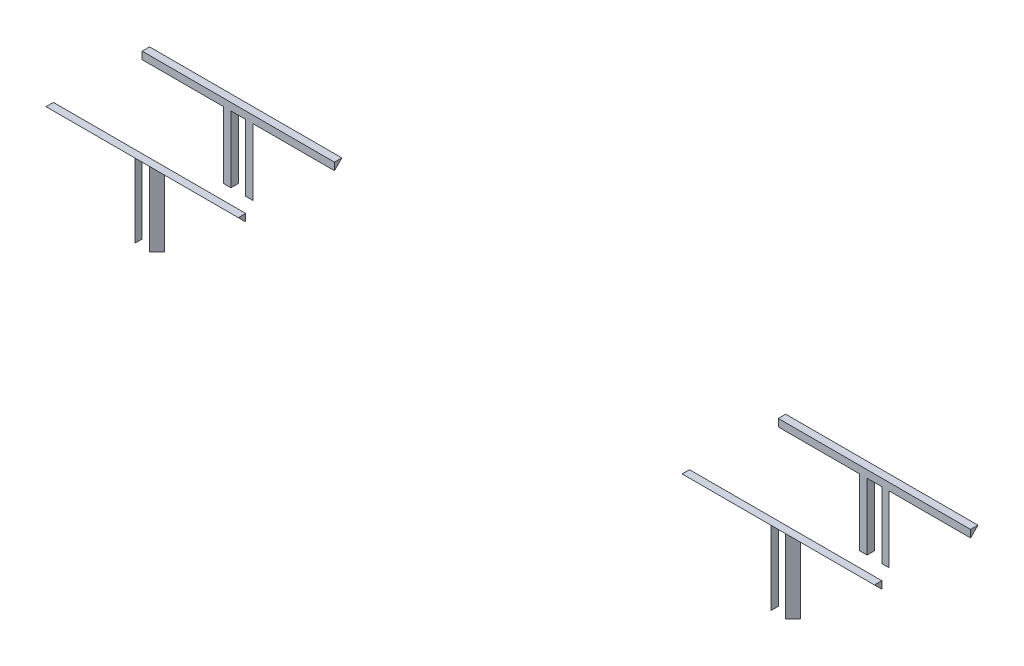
ISO-10303-21;
HEADER;
FILE_DESCRIPTION(('STEP AP214'),'2;1');
FILE_NAME('part.step','',(''),(''),'','','');
FILE_SCHEMA(('AUTOMOTIVE_DESIGN { 1 0 10303 214 1 1 1 1 }'));
ENDSEC;
DATA;
#1=APPLICATION_CONTEXT('core data for automotive mechanical design processes');
#2=APPLICATION_PROTOCOL_DEFINITION('international standard','automotive_design',2000,#1);
#3=PRODUCT_CONTEXT('',#1,'mechanical');
#4=PRODUCT('Part','Part','',(#3));
#5=PRODUCT_RELATED_PRODUCT_CATEGORY('part','',(#4));
#6=PRODUCT_DEFINITION_FORMATION('','',#4);
#7=PRODUCT_DEFINITION_CONTEXT('part definition',#1,'design');
#8=PRODUCT_DEFINITION('design','',#6,#7);
#9=PRODUCT_DEFINITION_SHAPE('','',#8);
#10=(LENGTH_UNIT() NAMED_UNIT(*) SI_UNIT(.MILLI.,.METRE.));
#11=(NAMED_UNIT(*) PLANE_ANGLE_UNIT() SI_UNIT($,.RADIAN.));
#12=(NAMED_UNIT(*) SI_UNIT($,.STERADIAN.) SOLID_ANGLE_UNIT());
#13=UNCERTAINTY_MEASURE_WITH_UNIT(LENGTH_MEASURE(1.E-05),#10,'distance_accuracy_value','');
#14=(GEOMETRIC_REPRESENTATION_CONTEXT(3) GLOBAL_UNCERTAINTY_ASSIGNED_CONTEXT((#13)) GLOBAL_UNIT_ASSIGNED_CONTEXT((#10,
#11,#12)) REPRESENTATION_CONTEXT('',''));
#15=CARTESIAN_POINT('',(0.,0.,0.));
#16=DIRECTION('',(0.,0.,1.));
#17=DIRECTION('',(1.,0.,0.));
#18=AXIS2_PLACEMENT_3D('',#15,#16,#17);
#19=CARTESIAN_POINT('',(238.343633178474,47.9752658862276,60.));
#20=DIRECTION('',(1.,0.,0.));
#21=DIRECTION('',(0.,0.,-1.));
#22=AXIS2_PLACEMENT_3D('',#19,#20,#21);
#23=PLANE('',#22);
#24=DIRECTION('',(0.,1.,0.));
#25=VECTOR('',#24,1.);
#26=CARTESIAN_POINT('',(238.343633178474,8.13078659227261,60.));
#27=LINE('',#26,#25);
#28=CARTESIAN_POINT('',(238.343633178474,47.9752658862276,60.));
#29=VERTEX_POINT('',#28);
#30=CARTESIAN_POINT('',(238.343633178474,42.9752658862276,60.));
#31=VERTEX_POINT('',#30);
#32=EDGE_CURVE('P0_E20',#29,#31,#27,.F.);
#33=ORIENTED_EDGE('',*,*,#32,.T.);
#34=DIRECTION('',(0.,-0.707106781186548,-0.707106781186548));
#35=VECTOR('',#34,1.);
#36=CARTESIAN_POINT('',(238.343633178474,42.9752658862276,60.));
#37=LINE('',#36,#35);
#38=CARTESIAN_POINT('',(238.343633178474,47.9752658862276,65.));
#39=VERTEX_POINT('',#38);
#40=EDGE_CURVE('P0_E171',#39,#31,#37,.T.);
#41=ORIENTED_EDGE('',*,*,#40,.F.);
#42=DIRECTION('',(0.,0.,-1.));
#43=VECTOR('',#42,1.);
#44=CARTESIAN_POINT('',(238.343633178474,47.9752658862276,30.0000000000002));
#45=LINE('',#44,#43);
#46=EDGE_CURVE('P0_E143',#39,#29,#45,.T.);
#47=ORIENTED_EDGE('',*,*,#46,.T.);
#48=EDGE_LOOP('',(#33,#41,#47));
#49=FACE_BOUND('',#48,.T.);
#50=ADVANCED_FACE('P0_F16',(#49),#23,.F.);
#51=CARTESIAN_POINT('',(238.343633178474,42.9752658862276,60.));
#52=DIRECTION('',(0.,-0.707106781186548,0.707106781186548));
#53=DIRECTION('',(0.,-0.707106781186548,-0.707106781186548));
#54=AXIS2_PLACEMENT_3D('',#51,#52,#53);
#55=PLANE('',#54);
#56=ORIENTED_EDGE('',*,*,#40,.T.);
#57=DIRECTION('',(1.,0.,0.));
#58=VECTOR('',#57,1.);
#59=CARTESIAN_POINT('',(88.3436331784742,42.9752658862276,60.));
#60=LINE('',#59,#58);
#61=CARTESIAN_POINT('',(293.343633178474,42.9752658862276,60.));
#62=VERTEX_POINT('',#61);
#63=EDGE_CURVE('P0_E167',#31,#62,#60,.T.);
#64=ORIENTED_EDGE('',*,*,#63,.T.);
#65=DIRECTION('',(-0.577350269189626,-0.577350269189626,-0.577350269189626));
#66=VECTOR('',#65,1.);
#67=CARTESIAN_POINT('',(298.343633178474,47.9752658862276,65.));
#68=LINE('',#67,#66);
#69=CARTESIAN_POINT('',(298.343633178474,47.9752658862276,65.));
#70=VERTEX_POINT('',#69);
#71=EDGE_CURVE('P0_E122',#70,#62,#68,.T.);
#72=ORIENTED_EDGE('',*,*,#71,.F.);
#73=DIRECTION('',(1.,0.,0.));
#74=VECTOR('',#73,1.);
#75=CARTESIAN_POINT('',(303.343633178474,47.9752658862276,65.));
#76=LINE('',#75,#74);
#77=EDGE_CURVE('P0_E145',#70,#39,#76,.F.);
#78=ORIENTED_EDGE('',*,*,#77,.T.);
#79=EDGE_LOOP('',(#56,#64,#72,#78));
#80=FACE_BOUND('',#79,.T.);
#81=ADVANCED_FACE('P0_F218',(#80),#55,.T.);
#82=CARTESIAN_POINT('',(298.343633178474,-2.0247341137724,65.));
#83=DIRECTION('',(-0.707106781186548,0.,0.707106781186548));
#84=DIRECTION('',(0.707106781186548,0.,0.707106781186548));
#85=AXIS2_PLACEMENT_3D('',#82,#83,#84);
#86=PLANE('',#85);
#87=DIRECTION('',(0.707106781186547,0.,0.707106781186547));
#88=VECTOR('',#87,1.);
#89=CARTESIAN_POINT('',(293.343633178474,-2.0247341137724,60.));
#90=LINE('',#89,#88);
#91=CARTESIAN_POINT('',(293.343633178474,-2.0247341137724,60.));
#92=VERTEX_POINT('',#91);
#93=CARTESIAN_POINT('',(298.343633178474,-2.0247341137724,65.));
#94=VERTEX_POINT('',#93);
#95=EDGE_CURVE('P0_E113',#92,#94,#90,.T.);
#96=ORIENTED_EDGE('',*,*,#95,.T.);
#97=DIRECTION('',(0.,1.,0.));
#98=VECTOR('',#97,1.);
#99=CARTESIAN_POINT('',(298.343633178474,22.9752658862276,65.));
#100=LINE('',#99,#98);
#101=EDGE_CURVE('P0_E103',#70,#94,#100,.F.);
#102=ORIENTED_EDGE('',*,*,#101,.F.);
#103=ORIENTED_EDGE('',*,*,#71,.T.);
#104=DIRECTION('',(0.,1.,0.));
#105=VECTOR('',#104,1.);
#106=CARTESIAN_POINT('',(293.343633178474,8.13078659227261,60.));
#107=LINE('',#106,#105);
#108=EDGE_CURVE('P0_E118',#62,#92,#107,.F.);
#109=ORIENTED_EDGE('',*,*,#108,.T.);
#110=EDGE_LOOP('',(#96,#102,#103,#109));
#111=FACE_BOUND('',#110,.T.);
#112=ADVANCED_FACE('P0_F116',(#111),#86,.T.);
#113=CARTESIAN_POINT('',(298.343633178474,-2.0247341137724,60.));
#114=DIRECTION('',(0.,1.,0.));
#115=DIRECTION('',(0.,0.,1.));
#116=AXIS2_PLACEMENT_3D('',#113,#114,#115);
#117=PLANE('',#116);
#118=ORIENTED_EDGE('',*,*,#95,.F.);
#119=DIRECTION('',(1.,0.,0.));
#120=VECTOR('',#119,1.);
#121=CARTESIAN_POINT('',(88.3436331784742,-2.0247341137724,60.));
#122=LINE('',#121,#120);
#123=CARTESIAN_POINT('',(298.343633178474,-2.0247341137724,60.));
#124=VERTEX_POINT('',#123);
#125=EDGE_CURVE('P0_E125',#92,#124,#122,.T.);
#126=ORIENTED_EDGE('',*,*,#125,.T.);
#127=DIRECTION('',(0.,0.,-1.));
#128=VECTOR('',#127,1.);
#129=CARTESIAN_POINT('',(298.343633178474,-2.0247341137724,120.));
#130=LINE('',#129,#128);
#131=EDGE_CURVE('P0_E108',#94,#124,#130,.T.);
#132=ORIENTED_EDGE('',*,*,#131,.F.);
#133=EDGE_LOOP('',(#118,#126,#132));
#134=FACE_BOUND('',#133,.T.);
#135=ADVANCED_FACE('P0_F124',(#134),#117,.F.);
#136=CARTESIAN_POINT('',(298.343633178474,22.9752658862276,120.));
#137=DIRECTION('',(1.,0.,0.));
#138=DIRECTION('',(0.,0.,-1.));
#139=AXIS2_PLACEMENT_3D('',#136,#137,#138);
#140=PLANE('',#139);
#141=ORIENTED_EDGE('',*,*,#131,.T.);
#142=DIRECTION('',(0.,1.,0.));
#143=VECTOR('',#142,1.);
#144=CARTESIAN_POINT('',(298.343633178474,8.13078659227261,60.));
#145=LINE('',#144,#143);
#146=CARTESIAN_POINT('',(298.343633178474,42.9752658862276,60.));
#147=VERTEX_POINT('',#146);
#148=EDGE_CURVE('P0_E164',#124,#147,#145,.T.);
#149=ORIENTED_EDGE('',*,*,#148,.T.);
#150=DIRECTION('',(0.,-0.707106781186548,-0.707106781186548));
#151=VECTOR('',#150,1.);
#152=CARTESIAN_POINT('',(298.343633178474,42.9752658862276,60.));
#153=LINE('',#152,#151);
#154=EDGE_CURVE('P0_E110',#70,#147,#153,.T.);
#155=ORIENTED_EDGE('',*,*,#154,.F.);
#156=ORIENTED_EDGE('',*,*,#101,.T.);
#157=EDGE_LOOP('',(#141,#149,#155,#156));
#158=FACE_BOUND('',#157,.T.);
#159=ADVANCED_FACE('P0_F105',(#158),#140,.T.);
#160=CARTESIAN_POINT('',(238.343633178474,42.9752658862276,60.));
#161=DIRECTION('',(0.,-0.707106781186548,0.707106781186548));
#162=DIRECTION('',(0.,-0.707106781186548,-0.707106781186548));
#163=AXIS2_PLACEMENT_3D('',#160,#161,#162);
#164=PLANE('',#163);
#165=ORIENTED_EDGE('',*,*,#154,.T.);
#166=DIRECTION('',(1.,0.,0.));
#167=VECTOR('',#166,1.);
#168=CARTESIAN_POINT('',(88.3436331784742,42.9752658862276,60.));
#169=LINE('',#168,#167);
#170=CARTESIAN_POINT('',(308.343633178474,42.9752658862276,60.));
#171=VERTEX_POINT('',#170);
#172=EDGE_CURVE('P0_E162',#147,#171,#169,.T.);
#173=ORIENTED_EDGE('',*,*,#172,.T.);
#174=DIRECTION('',(0.,0.707106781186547,0.707106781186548));
#175=VECTOR('',#174,1.);
#176=CARTESIAN_POINT('',(308.343633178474,42.9752658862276,60.));
#177=LINE('',#176,#175);
#178=CARTESIAN_POINT('',(308.343633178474,47.9752658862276,65.));
#179=VERTEX_POINT('',#178);
#180=EDGE_CURVE('P0_E90',#171,#179,#177,.T.);
#181=ORIENTED_EDGE('',*,*,#180,.T.);
#182=DIRECTION('',(1.,0.,0.));
#183=VECTOR('',#182,1.);
#184=CARTESIAN_POINT('',(303.343633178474,47.9752658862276,65.));
#185=LINE('',#184,#183);
#186=EDGE_CURVE('P0_E139',#179,#70,#185,.F.);
#187=ORIENTED_EDGE('',*,*,#186,.T.);
#188=EDGE_LOOP('',(#165,#173,#181,#187));
#189=FACE_BOUND('',#188,.T.);
#190=ADVANCED_FACE('P0_F204',(#189),#164,.T.);
#191=CARTESIAN_POINT('',(308.343633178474,22.9752658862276,120.));
#192=DIRECTION('',(1.,0.,0.));
#193=DIRECTION('',(0.,0.,-1.));
#194=AXIS2_PLACEMENT_3D('',#191,#192,#193);
#195=PLANE('',#194);
#196=DIRECTION('',(0.,1.,0.));
#197=VECTOR('',#196,1.);
#198=CARTESIAN_POINT('',(308.343633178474,8.13078659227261,60.));
#199=LINE('',#198,#197);
#200=CARTESIAN_POINT('',(308.343633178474,-2.0247341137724,60.));
#201=VERTEX_POINT('',#200);
#202=EDGE_CURVE('P0_E159',#171,#201,#199,.F.);
#203=ORIENTED_EDGE('',*,*,#202,.T.);
#204=DIRECTION('',(0.,0.,1.));
#205=VECTOR('',#204,1.);
#206=CARTESIAN_POINT('',(308.343633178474,-2.0247341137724,60.));
#207=LINE('',#206,#205);
#208=CARTESIAN_POINT('',(308.343633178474,-2.02473411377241,65.));
#209=VERTEX_POINT('',#208);
#210=EDGE_CURVE('P0_E131',#201,#209,#207,.T.);
#211=ORIENTED_EDGE('',*,*,#210,.T.);
#212=DIRECTION('',(0.,1.,0.));
#213=VECTOR('',#212,1.);
#214=CARTESIAN_POINT('',(308.343633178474,47.9752658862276,65.));
#215=LINE('',#214,#213);
#216=EDGE_CURVE('P0_E97',#179,#209,#215,.F.);
#217=ORIENTED_EDGE('',*,*,#216,.F.);
#218=ORIENTED_EDGE('',*,*,#180,.F.);
#219=EDGE_LOOP('',(#203,#211,#217,#218));
#220=FACE_BOUND('',#219,.T.);
#221=ADVANCED_FACE('P0_F199',(#220),#195,.F.);
#222=CARTESIAN_POINT('',(308.343633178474,-2.0247341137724,60.));
#223=DIRECTION('',(0.,1.,0.));
#224=DIRECTION('',(0.,0.,1.));
#225=AXIS2_PLACEMENT_3D('',#222,#223,#224);
#226=PLANE('',#225);
#227=DIRECTION('',(1.,0.,0.));
#228=VECTOR('',#227,1.);
#229=CARTESIAN_POINT('',(88.3436331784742,-2.0247341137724,60.));
#230=LINE('',#229,#228);
#231=CARTESIAN_POINT('',(313.343633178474,-2.02473411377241,60.));
#232=VERTEX_POINT('',#231);
#233=EDGE_CURVE('P0_E156',#201,#232,#230,.T.);
#234=ORIENTED_EDGE('',*,*,#233,.T.);
#235=DIRECTION('',(0.707106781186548,0.,-0.707106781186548));
#236=VECTOR('',#235,1.);
#237=CARTESIAN_POINT('',(308.343633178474,-2.02473411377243,65.));
#238=LINE('',#237,#236);
#239=EDGE_CURVE('P0_E133',#209,#232,#238,.T.);
#240=ORIENTED_EDGE('',*,*,#239,.F.);
#241=ORIENTED_EDGE('',*,*,#210,.F.);
#242=EDGE_LOOP('',(#234,#240,#241));
#243=FACE_BOUND('',#242,.T.);
#244=ADVANCED_FACE('P0_F195',(#243),#226,.F.);
#245=CARTESIAN_POINT('',(308.343633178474,47.9752658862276,65.));
#246=DIRECTION('',(0.707106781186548,0.,0.707106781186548));
#247=DIRECTION('',(0.707106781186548,0.,-0.707106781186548));
#248=AXIS2_PLACEMENT_3D('',#245,#246,#247);
#249=PLANE('',#248);
#250=ORIENTED_EDGE('',*,*,#239,.T.);
#251=DIRECTION('',(0.,1.,0.));
#252=VECTOR('',#251,1.);
#253=CARTESIAN_POINT('',(313.343633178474,8.13078659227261,60.));
#254=LINE('',#253,#252);
#255=CARTESIAN_POINT('',(313.343633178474,42.9752658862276,60.));
#256=VERTEX_POINT('',#255);
#257=EDGE_CURVE('P0_E153',#232,#256,#254,.T.);
#258=ORIENTED_EDGE('',*,*,#257,.T.);
#259=DIRECTION('',(0.577350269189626,-0.577350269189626,-0.577350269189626));
#260=VECTOR('',#259,1.);
#261=CARTESIAN_POINT('',(308.343633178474,47.9752658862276,65.));
#262=LINE('',#261,#260);
#263=EDGE_CURVE('P0_E135',#179,#256,#262,.T.);
#264=ORIENTED_EDGE('',*,*,#263,.F.);
#265=ORIENTED_EDGE('',*,*,#216,.T.);
#266=EDGE_LOOP('',(#250,#258,#264,#265));
#267=FACE_BOUND('',#266,.T.);
#268=ADVANCED_FACE('P0_F185',(#267),#249,.T.);
#269=CARTESIAN_POINT('',(238.343633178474,42.9752658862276,60.));
#270=DIRECTION('',(0.,-0.707106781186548,0.707106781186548));
#271=DIRECTION('',(0.,-0.707106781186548,-0.707106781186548));
#272=AXIS2_PLACEMENT_3D('',#269,#270,#271);
#273=PLANE('',#272);
#274=DIRECTION('',(0.,-0.707106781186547,-0.707106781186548));
#275=VECTOR('',#274,1.);
#276=CARTESIAN_POINT('',(368.343633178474,47.9752658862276,65.));
#277=LINE('',#276,#275);
#278=CARTESIAN_POINT('',(368.343633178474,47.9752658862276,65.));
#279=VERTEX_POINT('',#278);
#280=CARTESIAN_POINT('',(368.343633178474,42.9752658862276,60.));
#281=VERTEX_POINT('',#280);
#282=EDGE_CURVE('P0_E79',#279,#281,#277,.T.);
#283=ORIENTED_EDGE('',*,*,#282,.F.);
#284=DIRECTION('',(1.,0.,0.));
#285=VECTOR('',#284,1.);
#286=CARTESIAN_POINT('',(303.343633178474,47.9752658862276,65.));
#287=LINE('',#286,#285);
#288=EDGE_CURVE('P0_E140',#279,#179,#287,.F.);
#289=ORIENTED_EDGE('',*,*,#288,.T.);
#290=ORIENTED_EDGE('',*,*,#263,.T.);
#291=DIRECTION('',(1.,0.,0.));
#292=VECTOR('',#291,1.);
#293=CARTESIAN_POINT('',(88.3436331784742,42.9752658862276,60.));
#294=LINE('',#293,#292);
#295=EDGE_CURVE('P0_E151',#256,#281,#294,.T.);
#296=ORIENTED_EDGE('',*,*,#295,.T.);
#297=EDGE_LOOP('',(#283,#289,#290,#296));
#298=FACE_BOUND('',#297,.T.);
#299=ADVANCED_FACE('P0_F179',(#298),#273,.T.);
#300=CARTESIAN_POINT('',(368.343633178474,47.9752658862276,60.));
#301=DIRECTION('',(1.,0.,0.));
#302=DIRECTION('',(0.,0.,-1.));
#303=AXIS2_PLACEMENT_3D('',#300,#301,#302);
#304=PLANE('',#303);
#305=ORIENTED_EDGE('',*,*,#282,.T.);
#306=DIRECTION('',(0.,1.,0.));
#307=VECTOR('',#306,1.);
#308=CARTESIAN_POINT('',(368.343633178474,8.13078659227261,60.));
#309=LINE('',#308,#307);
#310=CARTESIAN_POINT('',(368.343633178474,47.9752658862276,60.));
#311=VERTEX_POINT('',#310);
#312=EDGE_CURVE('P0_E26',#281,#311,#309,.T.);
#313=ORIENTED_EDGE('',*,*,#312,.T.);
#314=DIRECTION('',(0.,0.,-1.));
#315=VECTOR('',#314,1.);
#316=CARTESIAN_POINT('',(368.343633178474,47.9752658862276,30.0000000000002));
#317=LINE('',#316,#315);
#318=EDGE_CURVE('P0_E34',#311,#279,#317,.F.);
#319=ORIENTED_EDGE('',*,*,#318,.T.);
#320=EDGE_LOOP('',(#305,#313,#319));
#321=FACE_BOUND('',#320,.T.);
#322=ADVANCED_FACE('P0_F177',(#321),#304,.T.);
#323=CARTESIAN_POINT('',(303.343633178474,47.9752658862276,30.0000000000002));
#324=DIRECTION('',(0.,-1.,0.));
#325=DIRECTION('',(0.,0.,-1.));
#326=AXIS2_PLACEMENT_3D('',#323,#324,#325);
#327=PLANE('',#326);
#328=ORIENTED_EDGE('',*,*,#318,.F.);
#329=DIRECTION('',(1.,0.,0.));
#330=VECTOR('',#329,1.);
#331=CARTESIAN_POINT('',(88.3436331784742,47.9752658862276,60.));
#332=LINE('',#331,#330);
#333=EDGE_CURVE('P0_E10',#311,#29,#332,.F.);
#334=ORIENTED_EDGE('',*,*,#333,.T.);
#335=ORIENTED_EDGE('',*,*,#46,.F.);
#336=ORIENTED_EDGE('',*,*,#77,.F.);
#337=ORIENTED_EDGE('',*,*,#186,.F.);
#338=ORIENTED_EDGE('',*,*,#288,.F.);
#339=EDGE_LOOP('',(#328,#334,#335,#336,#337,#338));
#340=FACE_BOUND('',#339,.T.);
#341=ADVANCED_FACE('P0_F173',(#340),#327,.F.);
#342=CARTESIAN_POINT('',(88.3436331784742,8.13078659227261,60.));
#343=DIRECTION('',(0.,0.,1.));
#344=DIRECTION('',(1.,0.,0.));
#345=AXIS2_PLACEMENT_3D('',#342,#343,#344);
#346=PLANE('',#345);
#347=ORIENTED_EDGE('',*,*,#312,.F.);
#348=ORIENTED_EDGE('',*,*,#295,.F.);
#349=ORIENTED_EDGE('',*,*,#257,.F.);
#350=ORIENTED_EDGE('',*,*,#233,.F.);
#351=ORIENTED_EDGE('',*,*,#202,.F.);
#352=ORIENTED_EDGE('',*,*,#172,.F.);
#353=ORIENTED_EDGE('',*,*,#148,.F.);
#354=ORIENTED_EDGE('',*,*,#125,.F.);
#355=ORIENTED_EDGE('',*,*,#108,.F.);
#356=ORIENTED_EDGE('',*,*,#63,.F.);
#357=ORIENTED_EDGE('',*,*,#32,.F.);
#358=ORIENTED_EDGE('',*,*,#333,.F.);
#359=EDGE_LOOP('',(#347,#348,#349,#350,#351,#352,#353,#354,#355,#356,#357,#358));
#360=FACE_BOUND('',#359,.T.);
#361=ADVANCED_FACE('P0_F18',(#360),#346,.F.);
#362=CLOSED_SHELL('',(#50,#81,#112,#135,#159,#190,#221,#244,#268,#299,#322,#341,#361));
#363=MANIFOLD_SOLID_BREP('P0_B1',#362);
#364=CARTESIAN_POINT('',(308.343633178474,22.9752658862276,-60.));
#365=DIRECTION('',(-1.,0.,0.));
#366=DIRECTION('',(0.,0.,1.));
#367=AXIS2_PLACEMENT_3D('',#364,#365,#366);
#368=PLANE('',#367);
#369=DIRECTION('',(0.,0.,1.));
#370=VECTOR('',#369,1.);
#371=CARTESIAN_POINT('',(308.343633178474,-2.02473411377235,0.));
#372=LINE('',#371,#370);
#373=CARTESIAN_POINT('',(308.343633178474,-2.02473411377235,-5.));
#374=VERTEX_POINT('',#373);
#375=CARTESIAN_POINT('',(308.343633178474,-2.02473411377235,0.));
#376=VERTEX_POINT('',#375);
#377=EDGE_CURVE('P1_E95',#374,#376,#372,.T.);
#378=ORIENTED_EDGE('',*,*,#377,.T.);
#379=DIRECTION('',(0.,1.,0.));
#380=VECTOR('',#379,1.);
#381=CARTESIAN_POINT('',(308.343633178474,8.13078659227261,0.));
#382=LINE('',#381,#380);
#383=CARTESIAN_POINT('',(308.343633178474,42.9752658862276,0.));
#384=VERTEX_POINT('',#383);
#385=EDGE_CURVE('P1_E20',#384,#376,#382,.F.);
#386=ORIENTED_EDGE('',*,*,#385,.F.);
#387=DIRECTION('',(0.,0.707106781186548,-0.707106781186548));
#388=VECTOR('',#387,1.);
#389=CARTESIAN_POINT('',(308.343633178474,42.9752658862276,0.));
#390=LINE('',#389,#388);
#391=CARTESIAN_POINT('',(308.343633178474,47.9752658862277,-5.00000000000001));
#392=VERTEX_POINT('',#391);
#393=EDGE_CURVE('P1_E105',#392,#384,#390,.F.);
#394=ORIENTED_EDGE('',*,*,#393,.F.);
#395=DIRECTION('',(0.,1.,0.));
#396=VECTOR('',#395,1.);
#397=CARTESIAN_POINT('',(308.343633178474,-2.02473411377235,-5.));
#398=LINE('',#397,#396);
#399=EDGE_CURVE('P1_E104',#374,#392,#398,.T.);
#400=ORIENTED_EDGE('',*,*,#399,.F.);
#401=EDGE_LOOP('',(#378,#386,#394,#400));
#402=FACE_BOUND('',#401,.T.);
#403=ADVANCED_FACE('P1_F16',(#402),#368,.T.);
#404=CARTESIAN_POINT('',(308.343633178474,-2.02473411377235,0.));
#405=DIRECTION('',(0.,1.,0.));
#406=DIRECTION('',(0.,0.,1.));
#407=AXIS2_PLACEMENT_3D('',#404,#405,#406);
#408=PLANE('',#407);
#409=DIRECTION('',(-0.707106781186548,0.,-0.707106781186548));
#410=VECTOR('',#409,1.);
#411=CARTESIAN_POINT('',(308.343633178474,-2.02473411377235,-5.));
#412=LINE('',#411,#410);
#413=CARTESIAN_POINT('',(313.343633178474,-2.02473411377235,0.));
#414=VERTEX_POINT('',#413);
#415=EDGE_CURVE('P1_E99',#414,#374,#412,.T.);
#416=ORIENTED_EDGE('',*,*,#415,.F.);
#417=DIRECTION('',(1.,0.,0.));
#418=VECTOR('',#417,1.);
#419=CARTESIAN_POINT('',(88.3436331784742,-2.02473411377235,0.));
#420=LINE('',#419,#418);
#421=EDGE_CURVE('P1_E102',#376,#414,#420,.T.);
#422=ORIENTED_EDGE('',*,*,#421,.F.);
#423=ORIENTED_EDGE('',*,*,#377,.F.);
#424=EDGE_LOOP('',(#416,#422,#423));
#425=FACE_BOUND('',#424,.T.);
#426=ADVANCED_FACE('P1_F97',(#425),#408,.F.);
#427=CARTESIAN_POINT('',(308.343633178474,-2.02473411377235,-5.));
#428=DIRECTION('',(0.707106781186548,0.,-0.707106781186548));
#429=DIRECTION('',(-0.707106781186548,0.,-0.707106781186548));
#430=AXIS2_PLACEMENT_3D('',#427,#428,#429);
#431=PLANE('',#430);
#432=ORIENTED_EDGE('',*,*,#415,.T.);
#433=ORIENTED_EDGE('',*,*,#399,.T.);
#434=DIRECTION('',(-0.577350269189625,0.577350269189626,-0.577350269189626));
#435=VECTOR('',#434,1.);
#436=CARTESIAN_POINT('',(313.343633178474,42.9752658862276,0.));
#437=LINE('',#436,#435);
#438=CARTESIAN_POINT('',(313.343633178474,42.9752658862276,0.));
#439=VERTEX_POINT('',#438);
#440=EDGE_CURVE('P1_E109',#439,#392,#437,.T.);
#441=ORIENTED_EDGE('',*,*,#440,.F.);
#442=DIRECTION('',(0.,1.,0.));
#443=VECTOR('',#442,1.);
#444=CARTESIAN_POINT('',(313.343633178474,8.13078659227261,0.));
#445=LINE('',#444,#443);
#446=EDGE_CURVE('P1_E113',#414,#439,#445,.T.);
#447=ORIENTED_EDGE('',*,*,#446,.F.);
#448=EDGE_LOOP('',(#432,#433,#441,#447));
#449=FACE_BOUND('',#448,.T.);
#450=ADVANCED_FACE('P1_F111',(#449),#431,.T.);
#451=CARTESIAN_POINT('',(368.343633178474,42.9752658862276,0.));
#452=DIRECTION('',(0.,-0.707106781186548,-0.707106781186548));
#453=DIRECTION('',(0.,0.707106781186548,-0.707106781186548));
#454=AXIS2_PLACEMENT_3D('',#451,#452,#453);
#455=PLANE('',#454);
#456=DIRECTION('',(0.,0.707106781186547,-0.707106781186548));
#457=VECTOR('',#456,1.);
#458=CARTESIAN_POINT('',(368.343633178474,42.9752658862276,0.));
#459=LINE('',#458,#457);
#460=CARTESIAN_POINT('',(368.343633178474,42.9752658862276,0.));
#461=VERTEX_POINT('',#460);
#462=CARTESIAN_POINT('',(368.343633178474,47.9752658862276,-5.));
#463=VERTEX_POINT('',#462);
#464=EDGE_CURVE('P1_E117',#461,#463,#459,.T.);
#465=ORIENTED_EDGE('',*,*,#464,.F.);
#466=DIRECTION('',(1.,0.,0.));
#467=VECTOR('',#466,1.);
#468=CARTESIAN_POINT('',(88.3436331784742,42.9752658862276,0.));
#469=LINE('',#468,#467);
#470=EDGE_CURVE('P1_E162',#439,#461,#469,.T.);
#471=ORIENTED_EDGE('',*,*,#470,.F.);
#472=ORIENTED_EDGE('',*,*,#440,.T.);
#473=DIRECTION('',(1.,0.,0.));
#474=VECTOR('',#473,1.);
#475=CARTESIAN_POINT('',(308.343633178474,47.9752658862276,-5.));
#476=LINE('',#475,#474);
#477=EDGE_CURVE('P1_E120',#463,#392,#476,.F.);
#478=ORIENTED_EDGE('',*,*,#477,.F.);
#479=EDGE_LOOP('',(#465,#471,#472,#478));
#480=FACE_BOUND('',#479,.T.);
#481=ADVANCED_FACE('P1_F174',(#480),#455,.T.);
#482=CARTESIAN_POINT('',(368.343633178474,47.9752658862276,0.));
#483=DIRECTION('',(1.,0.,0.));
#484=DIRECTION('',(0.,0.,-1.));
#485=AXIS2_PLACEMENT_3D('',#482,#483,#484);
#486=PLANE('',#485);
#487=ORIENTED_EDGE('',*,*,#464,.T.);
#488=DIRECTION('',(0.,0.,1.));
#489=VECTOR('',#488,1.);
#490=CARTESIAN_POINT('',(368.343633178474,47.9752658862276,0.));
#491=LINE('',#490,#489);
#492=CARTESIAN_POINT('',(368.343633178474,47.9752658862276,0.));
#493=VERTEX_POINT('',#492);
#494=EDGE_CURVE('P1_E119',#493,#463,#491,.F.);
#495=ORIENTED_EDGE('',*,*,#494,.F.);
#496=DIRECTION('',(0.,1.,0.));
#497=VECTOR('',#496,1.);
#498=CARTESIAN_POINT('',(368.343633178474,8.13078659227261,0.));
#499=LINE('',#498,#497);
#500=EDGE_CURVE('P1_E159',#461,#493,#499,.T.);
#501=ORIENTED_EDGE('',*,*,#500,.F.);
#502=EDGE_LOOP('',(#487,#495,#501));
#503=FACE_BOUND('',#502,.T.);
#504=ADVANCED_FACE('P1_F178',(#503),#486,.T.);
#505=CARTESIAN_POINT('',(308.343633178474,47.9752658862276,0.));
#506=DIRECTION('',(0.,1.,0.));
#507=DIRECTION('',(0.,0.,1.));
#508=AXIS2_PLACEMENT_3D('',#505,#506,#507);
#509=PLANE('',#508);
#510=DIRECTION('',(1.,0.,0.));
#511=VECTOR('',#510,1.);
#512=CARTESIAN_POINT('',(368.343633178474,47.9752658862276,-5.));
#513=LINE('',#512,#511);
#514=CARTESIAN_POINT('',(238.343633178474,47.9752658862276,-5.));
#515=VERTEX_POINT('',#514);
#516=CARTESIAN_POINT('',(298.343633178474,47.9752658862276,-5.));
#517=VERTEX_POINT('',#516);
#518=EDGE_CURVE('P1_E78',#515,#517,#513,.T.);
#519=ORIENTED_EDGE('',*,*,#518,.F.);
#520=DIRECTION('',(0.,0.,-1.));
#521=VECTOR('',#520,1.);
#522=CARTESIAN_POINT('',(238.343633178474,47.9752658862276,0.));
#523=LINE('',#522,#521);
#524=CARTESIAN_POINT('',(238.343633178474,47.9752658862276,0.));
#525=VERTEX_POINT('',#524);
#526=EDGE_CURVE('P1_E122',#515,#525,#523,.F.);
#527=ORIENTED_EDGE('',*,*,#526,.T.);
#528=DIRECTION('',(1.,0.,0.));
#529=VECTOR('',#528,1.);
#530=CARTESIAN_POINT('',(88.3436331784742,47.9752658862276,0.));
#531=LINE('',#530,#529);
#532=EDGE_CURVE('P1_E156',#493,#525,#531,.F.);
#533=ORIENTED_EDGE('',*,*,#532,.F.);
#534=ORIENTED_EDGE('',*,*,#494,.T.);
#535=ORIENTED_EDGE('',*,*,#477,.T.);
#536=DIRECTION('',(1.,0.,0.));
#537=VECTOR('',#536,1.);
#538=CARTESIAN_POINT('',(368.343633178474,47.9752658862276,-5.00000000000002));
#539=LINE('',#538,#537);
#540=EDGE_CURVE('P1_E137',#517,#392,#539,.T.);
#541=ORIENTED_EDGE('',*,*,#540,.F.);
#542=EDGE_LOOP('',(#519,#527,#533,#534,#535,#541));
#543=FACE_BOUND('',#542,.T.);
#544=ADVANCED_FACE('P1_F170',(#543),#509,.T.);
#545=CARTESIAN_POINT('',(238.343633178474,47.9752658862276,0.));
#546=DIRECTION('',(1.,0.,0.));
#547=DIRECTION('',(0.,0.,-1.));
#548=AXIS2_PLACEMENT_3D('',#545,#546,#547);
#549=PLANE('',#548);
#550=ORIENTED_EDGE('',*,*,#526,.F.);
#551=DIRECTION('',(0.,0.707106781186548,-0.707106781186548));
#552=VECTOR('',#551,1.);
#553=CARTESIAN_POINT('',(238.343633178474,42.9752658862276,0.));
#554=LINE('',#553,#552);
#555=CARTESIAN_POINT('',(238.343633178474,42.9752658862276,0.));
#556=VERTEX_POINT('',#555);
#557=EDGE_CURVE('P1_E126',#556,#515,#554,.T.);
#558=ORIENTED_EDGE('',*,*,#557,.F.);
#559=DIRECTION('',(0.,1.,0.));
#560=VECTOR('',#559,1.);
#561=CARTESIAN_POINT('',(238.343633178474,8.13078659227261,0.));
#562=LINE('',#561,#560);
#563=EDGE_CURVE('P1_E153',#525,#556,#562,.F.);
#564=ORIENTED_EDGE('',*,*,#563,.F.);
#565=EDGE_LOOP('',(#550,#558,#564));
#566=FACE_BOUND('',#565,.T.);
#567=ADVANCED_FACE('P1_F181',(#566),#549,.F.);
#568=CARTESIAN_POINT('',(368.343633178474,42.9752658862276,0.));
#569=DIRECTION('',(0.,-0.707106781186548,-0.707106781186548));
#570=DIRECTION('',(0.,0.707106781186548,-0.707106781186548));
#571=AXIS2_PLACEMENT_3D('',#568,#569,#570);
#572=PLANE('',#571);
#573=ORIENTED_EDGE('',*,*,#557,.T.);
#574=ORIENTED_EDGE('',*,*,#518,.T.);
#575=DIRECTION('',(0.577350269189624,0.577350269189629,-0.577350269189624));
#576=VECTOR('',#575,1.);
#577=CARTESIAN_POINT('',(293.343633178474,42.9752658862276,0.));
#578=LINE('',#577,#576);
#579=CARTESIAN_POINT('',(293.343633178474,42.9752658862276,0.));
#580=VERTEX_POINT('',#579);
#581=EDGE_CURVE('P1_E128',#580,#517,#578,.T.);
#582=ORIENTED_EDGE('',*,*,#581,.F.);
#583=DIRECTION('',(1.,0.,0.));
#584=VECTOR('',#583,1.);
#585=CARTESIAN_POINT('',(88.3436331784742,42.9752658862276,0.));
#586=LINE('',#585,#584);
#587=EDGE_CURVE('P1_E150',#556,#580,#586,.T.);
#588=ORIENTED_EDGE('',*,*,#587,.F.);
#589=EDGE_LOOP('',(#573,#574,#582,#588));
#590=FACE_BOUND('',#589,.T.);
#591=ADVANCED_FACE('P1_F184',(#590),#572,.T.);
#592=CARTESIAN_POINT('',(298.343633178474,47.9752658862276,-5.));
#593=DIRECTION('',(-0.707106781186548,0.,-0.707106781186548));
#594=DIRECTION('',(-0.707106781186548,0.,0.707106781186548));
#595=AXIS2_PLACEMENT_3D('',#592,#593,#594);
#596=PLANE('',#595);
#597=DIRECTION('',(-0.707106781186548,0.,0.707106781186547));
#598=VECTOR('',#597,1.);
#599=CARTESIAN_POINT('',(298.343633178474,-2.02473411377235,-5.));
#600=LINE('',#599,#598);
#601=CARTESIAN_POINT('',(298.343633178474,-2.02473411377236,-5.));
#602=VERTEX_POINT('',#601);
#603=CARTESIAN_POINT('',(293.343633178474,-2.02473411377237,0.));
#604=VERTEX_POINT('',#603);
#605=EDGE_CURVE('P1_E131',#602,#604,#600,.T.);
#606=ORIENTED_EDGE('',*,*,#605,.T.);
#607=DIRECTION('',(0.,1.,0.));
#608=VECTOR('',#607,1.);
#609=CARTESIAN_POINT('',(293.343633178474,8.13078659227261,0.));
#610=LINE('',#609,#608);
#611=EDGE_CURVE('P1_E147',#580,#604,#610,.F.);
#612=ORIENTED_EDGE('',*,*,#611,.F.);
#613=ORIENTED_EDGE('',*,*,#581,.T.);
#614=DIRECTION('',(0.,1.,0.));
#615=VECTOR('',#614,1.);
#616=CARTESIAN_POINT('',(298.343633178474,22.9752658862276,-5.));
#617=LINE('',#616,#615);
#618=EDGE_CURVE('P1_E133',#517,#602,#617,.F.);
#619=ORIENTED_EDGE('',*,*,#618,.T.);
#620=EDGE_LOOP('',(#606,#612,#613,#619));
#621=FACE_BOUND('',#620,.T.);
#622=ADVANCED_FACE('P1_F186',(#621),#596,.T.);
#623=CARTESIAN_POINT('',(298.343633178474,-2.02473411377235,0.));
#624=DIRECTION('',(0.,1.,0.));
#625=DIRECTION('',(0.,0.,1.));
#626=AXIS2_PLACEMENT_3D('',#623,#624,#625);
#627=PLANE('',#626);
#628=DIRECTION('',(1.,0.,0.));
#629=VECTOR('',#628,1.);
#630=CARTESIAN_POINT('',(88.3436331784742,-2.02473411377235,0.));
#631=LINE('',#630,#629);
#632=CARTESIAN_POINT('',(298.343633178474,-2.02473411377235,0.));
#633=VERTEX_POINT('',#632);
#634=EDGE_CURVE('P1_E144',#604,#633,#631,.T.);
#635=ORIENTED_EDGE('',*,*,#634,.F.);
#636=ORIENTED_EDGE('',*,*,#605,.F.);
#637=DIRECTION('',(0.,0.,1.));
#638=VECTOR('',#637,1.);
#639=CARTESIAN_POINT('',(298.343633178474,-2.02473411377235,-60.));
#640=LINE('',#639,#638);
#641=EDGE_CURVE('P1_E134',#602,#633,#640,.T.);
#642=ORIENTED_EDGE('',*,*,#641,.T.);
#643=EDGE_LOOP('',(#635,#636,#642));
#644=FACE_BOUND('',#643,.T.);
#645=ADVANCED_FACE('P1_F191',(#644),#627,.F.);
#646=CARTESIAN_POINT('',(298.343633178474,22.9752658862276,-60.));
#647=DIRECTION('',(-1.,0.,0.));
#648=DIRECTION('',(0.,0.,1.));
#649=AXIS2_PLACEMENT_3D('',#646,#647,#648);
#650=PLANE('',#649);
#651=DIRECTION('',(0.,1.,0.));
#652=VECTOR('',#651,1.);
#653=CARTESIAN_POINT('',(298.343633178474,8.13078659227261,0.));
#654=LINE('',#653,#652);
#655=CARTESIAN_POINT('',(298.343633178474,42.9752658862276,0.));
#656=VERTEX_POINT('',#655);
#657=EDGE_CURVE('P1_E26',#633,#656,#654,.T.);
#658=ORIENTED_EDGE('',*,*,#657,.F.);
#659=ORIENTED_EDGE('',*,*,#641,.F.);
#660=ORIENTED_EDGE('',*,*,#618,.F.);
#661=DIRECTION('',(0.,0.707106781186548,-0.707106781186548));
#662=VECTOR('',#661,1.);
#663=CARTESIAN_POINT('',(298.343633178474,42.9752658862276,0.));
#664=LINE('',#663,#662);
#665=EDGE_CURVE('P1_E35',#656,#517,#664,.T.);
#666=ORIENTED_EDGE('',*,*,#665,.F.);
#667=EDGE_LOOP('',(#658,#659,#660,#666));
#668=FACE_BOUND('',#667,.T.);
#669=ADVANCED_FACE('P1_F192',(#668),#650,.F.);
#670=CARTESIAN_POINT('',(368.343633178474,42.9752658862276,0.));
#671=DIRECTION('',(0.,-0.707106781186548,-0.707106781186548));
#672=DIRECTION('',(0.,0.707106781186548,-0.707106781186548));
#673=AXIS2_PLACEMENT_3D('',#670,#671,#672);
#674=PLANE('',#673);
#675=ORIENTED_EDGE('',*,*,#665,.T.);
#676=ORIENTED_EDGE('',*,*,#540,.T.);
#677=ORIENTED_EDGE('',*,*,#393,.T.);
#678=DIRECTION('',(1.,0.,0.));
#679=VECTOR('',#678,1.);
#680=CARTESIAN_POINT('',(88.3436331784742,42.9752658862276,0.));
#681=LINE('',#680,#679);
#682=EDGE_CURVE('P1_E10',#656,#384,#681,.T.);
#683=ORIENTED_EDGE('',*,*,#682,.F.);
#684=EDGE_LOOP('',(#675,#676,#677,#683));
#685=FACE_BOUND('',#684,.T.);
#686=ADVANCED_FACE('P1_F167',(#685),#674,.T.);
#687=CARTESIAN_POINT('',(88.3436331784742,8.13078659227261,0.));
#688=DIRECTION('',(0.,0.,1.));
#689=DIRECTION('',(1.,0.,0.));
#690=AXIS2_PLACEMENT_3D('',#687,#688,#689);
#691=PLANE('',#690);
#692=ORIENTED_EDGE('',*,*,#657,.T.);
#693=ORIENTED_EDGE('',*,*,#682,.T.);
#694=ORIENTED_EDGE('',*,*,#385,.T.);
#695=ORIENTED_EDGE('',*,*,#421,.T.);
#696=ORIENTED_EDGE('',*,*,#446,.T.);
#697=ORIENTED_EDGE('',*,*,#470,.T.);
#698=ORIENTED_EDGE('',*,*,#500,.T.);
#699=ORIENTED_EDGE('',*,*,#532,.T.);
#700=ORIENTED_EDGE('',*,*,#563,.T.);
#701=ORIENTED_EDGE('',*,*,#587,.T.);
#702=ORIENTED_EDGE('',*,*,#611,.T.);
#703=ORIENTED_EDGE('',*,*,#634,.T.);
#704=EDGE_LOOP('',(#692,#693,#694,#695,#696,#697,#698,#699,#700,#701,#702,#703));
#705=FACE_BOUND('',#704,.T.);
#706=ADVANCED_FACE('P1_F18',(#705),#691,.T.);
#707=CLOSED_SHELL('',(#403,#426,#450,#481,#504,#544,#567,#591,#622,#645,#669,#686,#706));
#708=MANIFOLD_SOLID_BREP('P1_B1',#707);
#709=CARTESIAN_POINT('',(-126.656366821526,47.9752658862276,30.0000000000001));
#710=DIRECTION('',(0.,-1.,0.));
#711=DIRECTION('',(0.,0.,-1.));
#712=AXIS2_PLACEMENT_3D('',#709,#710,#711);
#713=PLANE('',#712);
#714=DIRECTION('',(0.,0.,-1.));
#715=VECTOR('',#714,1.);
#716=CARTESIAN_POINT('',(-191.656366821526,47.9752658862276,0.));
#717=LINE('',#716,#715);
#718=CARTESIAN_POINT('',(-191.656366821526,47.9752658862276,-5.));
#719=VERTEX_POINT('',#718);
#720=CARTESIAN_POINT('',(-191.656366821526,47.9752658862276,0.));
#721=VERTEX_POINT('',#720);
#722=EDGE_CURVE('P2_E97',#719,#721,#717,.F.);
#723=ORIENTED_EDGE('',*,*,#722,.T.);
#724=DIRECTION('',(1.,0.,0.));
#725=VECTOR('',#724,1.);
#726=CARTESIAN_POINT('',(88.3436331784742,47.9752658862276,0.));
#727=LINE('',#726,#725);
#728=CARTESIAN_POINT('',(-61.6563668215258,47.9752658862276,0.));
#729=VERTEX_POINT('',#728);
#730=EDGE_CURVE('P2_E20',#729,#721,#727,.F.);
#731=ORIENTED_EDGE('',*,*,#730,.F.);
#732=DIRECTION('',(0.,0.,-1.));
#733=VECTOR('',#732,1.);
#734=CARTESIAN_POINT('',(-61.6563668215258,47.9752658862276,0.));
#735=LINE('',#734,#733);
#736=CARTESIAN_POINT('',(-61.6563668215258,47.9752658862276,-5.));
#737=VERTEX_POINT('',#736);
#738=EDGE_CURVE('P2_E139',#737,#729,#735,.F.);
#739=ORIENTED_EDGE('',*,*,#738,.F.);
#740=DIRECTION('',(1.,0.,0.));
#741=VECTOR('',#740,1.);
#742=CARTESIAN_POINT('',(-61.6563668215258,47.9752658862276,-5.));
#743=LINE('',#742,#741);
#744=CARTESIAN_POINT('',(-121.656366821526,47.9752658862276,-5.));
#745=VERTEX_POINT('',#744);
#746=EDGE_CURVE('P2_E76',#745,#737,#743,.T.);
#747=ORIENTED_EDGE('',*,*,#746,.F.);
#748=DIRECTION('',(1.,0.,0.));
#749=VECTOR('',#748,1.);
#750=CARTESIAN_POINT('',(-61.6563668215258,47.9752658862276,-5.));
#751=LINE('',#750,#749);
#752=CARTESIAN_POINT('',(-131.656366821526,47.9752658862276,-5.));
#753=VERTEX_POINT('',#752);
#754=EDGE_CURVE('P2_E82',#753,#745,#751,.T.);
#755=ORIENTED_EDGE('',*,*,#754,.F.);
#756=DIRECTION('',(1.,0.,0.));
#757=VECTOR('',#756,1.);
#758=CARTESIAN_POINT('',(-61.6563668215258,47.9752658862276,-5.));
#759=LINE('',#758,#757);
#760=EDGE_CURVE('P2_E106',#719,#753,#759,.T.);
#761=ORIENTED_EDGE('',*,*,#760,.F.);
#762=EDGE_LOOP('',(#723,#731,#739,#747,#755,#761));
#763=FACE_BOUND('',#762,.T.);
#764=ADVANCED_FACE('P2_F16',(#763),#713,.F.);
#765=CARTESIAN_POINT('',(-191.656366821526,47.9752658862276,0.));
#766=DIRECTION('',(1.,0.,0.));
#767=DIRECTION('',(0.,0.,-1.));
#768=AXIS2_PLACEMENT_3D('',#765,#766,#767);
#769=PLANE('',#768);
#770=ORIENTED_EDGE('',*,*,#722,.F.);
#771=DIRECTION('',(0.,0.707106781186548,-0.707106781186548));
#772=VECTOR('',#771,1.);
#773=CARTESIAN_POINT('',(-191.656366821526,42.9752658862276,0.));
#774=LINE('',#773,#772);
#775=CARTESIAN_POINT('',(-191.656366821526,42.9752658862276,0.));
#776=VERTEX_POINT('',#775);
#777=EDGE_CURVE('P2_E101',#776,#719,#774,.T.);
#778=ORIENTED_EDGE('',*,*,#777,.F.);
#779=DIRECTION('',(0.,1.,0.));
#780=VECTOR('',#779,1.);
#781=CARTESIAN_POINT('',(-191.656366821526,8.13078659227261,0.));
#782=LINE('',#781,#780);
#783=EDGE_CURVE('P2_E104',#721,#776,#782,.F.);
#784=ORIENTED_EDGE('',*,*,#783,.F.);
#785=EDGE_LOOP('',(#770,#778,#784));
#786=FACE_BOUND('',#785,.T.);
#787=ADVANCED_FACE('P2_F99',(#786),#769,.F.);
#788=CARTESIAN_POINT('',(-61.6563668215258,42.9752658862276,0.));
#789=DIRECTION('',(0.,-0.707106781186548,-0.707106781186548));
#790=DIRECTION('',(0.,0.707106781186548,-0.707106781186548));
#791=AXIS2_PLACEMENT_3D('',#788,#789,#790);
#792=PLANE('',#791);
#793=ORIENTED_EDGE('',*,*,#777,.T.);
#794=ORIENTED_EDGE('',*,*,#760,.T.);
#795=DIRECTION('',(0.577350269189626,0.577350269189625,-0.577350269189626));
#796=VECTOR('',#795,1.);
#797=CARTESIAN_POINT('',(-136.656366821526,42.9752658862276,0.));
#798=LINE('',#797,#796);
#799=CARTESIAN_POINT('',(-136.656366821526,42.9752658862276,0.));
#800=VERTEX_POINT('',#799);
#801=EDGE_CURVE('P2_E109',#800,#753,#798,.T.);
#802=ORIENTED_EDGE('',*,*,#801,.F.);
#803=DIRECTION('',(1.,0.,0.));
#804=VECTOR('',#803,1.);
#805=CARTESIAN_POINT('',(88.3436331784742,42.9752658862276,0.));
#806=LINE('',#805,#804);
#807=EDGE_CURVE('P2_E113',#776,#800,#806,.T.);
#808=ORIENTED_EDGE('',*,*,#807,.F.);
#809=EDGE_LOOP('',(#793,#794,#802,#808));
#810=FACE_BOUND('',#809,.T.);
#811=ADVANCED_FACE('P2_F111',(#810),#792,.T.);
#812=CARTESIAN_POINT('',(-131.656366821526,47.9752658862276,-5.));
#813=DIRECTION('',(-0.707106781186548,0.,-0.707106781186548));
#814=DIRECTION('',(-0.707106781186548,0.,0.707106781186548));
#815=AXIS2_PLACEMENT_3D('',#812,#813,#814);
#816=PLANE('',#815);
#817=DIRECTION('',(-0.707106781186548,0.,0.707106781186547));
#818=VECTOR('',#817,1.);
#819=CARTESIAN_POINT('',(-131.656366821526,-2.0247341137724,-5.));
#820=LINE('',#819,#818);
#821=CARTESIAN_POINT('',(-131.656366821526,-2.02473411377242,-5.));
#822=VERTEX_POINT('',#821);
#823=CARTESIAN_POINT('',(-136.656366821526,-2.02473411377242,0.));
#824=VERTEX_POINT('',#823);
#825=EDGE_CURVE('P2_E117',#822,#824,#820,.T.);
#826=ORIENTED_EDGE('',*,*,#825,.T.);
#827=DIRECTION('',(0.,1.,0.));
#828=VECTOR('',#827,1.);
#829=CARTESIAN_POINT('',(-136.656366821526,8.13078659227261,0.));
#830=LINE('',#829,#828);
#831=EDGE_CURVE('P2_E162',#800,#824,#830,.F.);
#832=ORIENTED_EDGE('',*,*,#831,.F.);
#833=ORIENTED_EDGE('',*,*,#801,.T.);
#834=DIRECTION('',(0.,1.,0.));
#835=VECTOR('',#834,1.);
#836=CARTESIAN_POINT('',(-131.656366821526,22.9752658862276,-5.));
#837=LINE('',#836,#835);
#838=EDGE_CURVE('P2_E119',#753,#822,#837,.F.);
#839=ORIENTED_EDGE('',*,*,#838,.T.);
#840=EDGE_LOOP('',(#826,#832,#833,#839));
#841=FACE_BOUND('',#840,.T.);
#842=ADVANCED_FACE('P2_F187',(#841),#816,.T.);
#843=CARTESIAN_POINT('',(-131.656366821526,-2.0247341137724,0.));
#844=DIRECTION('',(0.,1.,0.));
#845=DIRECTION('',(0.,0.,1.));
#846=AXIS2_PLACEMENT_3D('',#843,#844,#845);
#847=PLANE('',#846);
#848=DIRECTION('',(1.,0.,0.));
#849=VECTOR('',#848,1.);
#850=CARTESIAN_POINT('',(88.3436331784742,-2.0247341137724,0.));
#851=LINE('',#850,#849);
#852=CARTESIAN_POINT('',(-131.656366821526,-2.0247341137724,0.));
#853=VERTEX_POINT('',#852);
#854=EDGE_CURVE('P2_E159',#824,#853,#851,.T.);
#855=ORIENTED_EDGE('',*,*,#854,.F.);
#856=ORIENTED_EDGE('',*,*,#825,.F.);
#857=DIRECTION('',(0.,0.,1.));
#858=VECTOR('',#857,1.);
#859=CARTESIAN_POINT('',(-131.656366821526,-2.0247341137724,-60.));
#860=LINE('',#859,#858);
#861=EDGE_CURVE('P2_E120',#822,#853,#860,.T.);
#862=ORIENTED_EDGE('',*,*,#861,.T.);
#863=EDGE_LOOP('',(#855,#856,#862));
#864=FACE_BOUND('',#863,.T.);
#865=ADVANCED_FACE('P2_F190',(#864),#847,.F.);
#866=CARTESIAN_POINT('',(-131.656366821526,22.9752658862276,-60.));
#867=DIRECTION('',(-1.,0.,0.));
#868=DIRECTION('',(0.,0.,1.));
#869=AXIS2_PLACEMENT_3D('',#866,#867,#868);
#870=PLANE('',#869);
#871=DIRECTION('',(0.,1.,0.));
#872=VECTOR('',#871,1.);
#873=CARTESIAN_POINT('',(-131.656366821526,8.13078659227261,0.));
#874=LINE('',#873,#872);
#875=CARTESIAN_POINT('',(-131.656366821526,42.9752658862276,0.));
#876=VERTEX_POINT('',#875);
#877=EDGE_CURVE('P2_E156',#853,#876,#874,.T.);
#878=ORIENTED_EDGE('',*,*,#877,.F.);
#879=ORIENTED_EDGE('',*,*,#861,.F.);
#880=ORIENTED_EDGE('',*,*,#838,.F.);
#881=DIRECTION('',(0.,0.707106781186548,-0.707106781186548));
#882=VECTOR('',#881,1.);
#883=CARTESIAN_POINT('',(-131.656366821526,42.9752658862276,0.));
#884=LINE('',#883,#882);
#885=EDGE_CURVE('P2_E122',#876,#753,#884,.T.);
#886=ORIENTED_EDGE('',*,*,#885,.F.);
#887=EDGE_LOOP('',(#878,#879,#880,#886));
#888=FACE_BOUND('',#887,.T.);
#889=ADVANCED_FACE('P2_F183',(#888),#870,.F.);
#890=CARTESIAN_POINT('',(-61.6563668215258,42.9752658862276,0.));
#891=DIRECTION('',(0.,-0.707106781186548,-0.707106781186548));
#892=DIRECTION('',(0.,0.707106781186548,-0.707106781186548));
#893=AXIS2_PLACEMENT_3D('',#890,#891,#892);
#894=PLANE('',#893);
#895=DIRECTION('',(0.,0.707106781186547,-0.707106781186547));
#896=VECTOR('',#895,1.);
#897=CARTESIAN_POINT('',(-121.656366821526,42.9752658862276,0.));
#898=LINE('',#897,#896);
#899=CARTESIAN_POINT('',(-121.656366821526,42.9752658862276,0.));
#900=VERTEX_POINT('',#899);
#901=EDGE_CURVE('P2_E125',#900,#745,#898,.T.);
#902=ORIENTED_EDGE('',*,*,#901,.F.);
#903=DIRECTION('',(1.,0.,0.));
#904=VECTOR('',#903,1.);
#905=CARTESIAN_POINT('',(88.3436331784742,42.9752658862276,0.));
#906=LINE('',#905,#904);
#907=EDGE_CURVE('P2_E153',#876,#900,#906,.T.);
#908=ORIENTED_EDGE('',*,*,#907,.F.);
#909=ORIENTED_EDGE('',*,*,#885,.T.);
#910=ORIENTED_EDGE('',*,*,#754,.T.);
#911=EDGE_LOOP('',(#902,#908,#909,#910));
#912=FACE_BOUND('',#911,.T.);
#913=ADVANCED_FACE('P2_F178',(#912),#894,.T.);
#914=CARTESIAN_POINT('',(-121.656366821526,22.9752658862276,-60.));
#915=DIRECTION('',(-1.,0.,0.));
#916=DIRECTION('',(0.,0.,1.));
#917=AXIS2_PLACEMENT_3D('',#914,#915,#916);
#918=PLANE('',#917);
#919=DIRECTION('',(0.,0.,1.));
#920=VECTOR('',#919,1.);
#921=CARTESIAN_POINT('',(-121.656366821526,-2.0247341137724,0.));
#922=LINE('',#921,#920);
#923=CARTESIAN_POINT('',(-121.656366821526,-2.0247341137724,-5.));
#924=VERTEX_POINT('',#923);
#925=CARTESIAN_POINT('',(-121.656366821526,-2.0247341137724,0.));
#926=VERTEX_POINT('',#925);
#927=EDGE_CURVE('P2_E128',#924,#926,#922,.T.);
#928=ORIENTED_EDGE('',*,*,#927,.T.);
#929=DIRECTION('',(0.,1.,0.));
#930=VECTOR('',#929,1.);
#931=CARTESIAN_POINT('',(-121.656366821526,8.13078659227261,0.));
#932=LINE('',#931,#930);
#933=EDGE_CURVE('P2_E150',#900,#926,#932,.F.);
#934=ORIENTED_EDGE('',*,*,#933,.F.);
#935=ORIENTED_EDGE('',*,*,#901,.T.);
#936=DIRECTION('',(0.,1.,0.));
#937=VECTOR('',#936,1.);
#938=CARTESIAN_POINT('',(-121.656366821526,-2.0247341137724,-5.));
#939=LINE('',#938,#937);
#940=EDGE_CURVE('P2_E131',#924,#745,#939,.T.);
#941=ORIENTED_EDGE('',*,*,#940,.F.);
#942=EDGE_LOOP('',(#928,#934,#935,#941));
#943=FACE_BOUND('',#942,.T.);
#944=ADVANCED_FACE('P2_F174',(#943),#918,.T.);
#945=CARTESIAN_POINT('',(-121.656366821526,-2.0247341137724,0.));
#946=DIRECTION('',(0.,1.,0.));
#947=DIRECTION('',(0.,0.,1.));
#948=AXIS2_PLACEMENT_3D('',#945,#946,#947);
#949=PLANE('',#948);
#950=DIRECTION('',(-0.707106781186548,0.,-0.707106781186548));
#951=VECTOR('',#950,1.);
#952=CARTESIAN_POINT('',(-121.656366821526,-2.0247341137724,-5.));
#953=LINE('',#952,#951);
#954=CARTESIAN_POINT('',(-116.656366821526,-2.0247341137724,0.));
#955=VERTEX_POINT('',#954);
#956=EDGE_CURVE('P2_E130',#955,#924,#953,.T.);
#957=ORIENTED_EDGE('',*,*,#956,.F.);
#958=DIRECTION('',(1.,0.,0.));
#959=VECTOR('',#958,1.);
#960=CARTESIAN_POINT('',(88.3436331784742,-2.0247341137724,0.));
#961=LINE('',#960,#959);
#962=EDGE_CURVE('P2_E147',#926,#955,#961,.T.);
#963=ORIENTED_EDGE('',*,*,#962,.F.);
#964=ORIENTED_EDGE('',*,*,#927,.F.);
#965=EDGE_LOOP('',(#957,#963,#964));
#966=FACE_BOUND('',#965,.T.);
#967=ADVANCED_FACE('P2_F208',(#966),#949,.F.);
#968=CARTESIAN_POINT('',(-121.656366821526,-2.0247341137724,-5.));
#969=DIRECTION('',(0.707106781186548,0.,-0.707106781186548));
#970=DIRECTION('',(-0.707106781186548,0.,-0.707106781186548));
#971=AXIS2_PLACEMENT_3D('',#968,#969,#970);
#972=PLANE('',#971);
#973=ORIENTED_EDGE('',*,*,#956,.T.);
#974=ORIENTED_EDGE('',*,*,#940,.T.);
#975=DIRECTION('',(-0.577350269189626,0.577350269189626,-0.577350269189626));
#976=VECTOR('',#975,1.);
#977=CARTESIAN_POINT('',(-116.656366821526,42.9752658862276,0.));
#978=LINE('',#977,#976);
#979=CARTESIAN_POINT('',(-116.656366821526,42.9752658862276,0.));
#980=VERTEX_POINT('',#979);
#981=EDGE_CURVE('P2_E134',#980,#745,#978,.T.);
#982=ORIENTED_EDGE('',*,*,#981,.F.);
#983=DIRECTION('',(0.,1.,0.));
#984=VECTOR('',#983,1.);
#985=CARTESIAN_POINT('',(-116.656366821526,8.13078659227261,0.));
#986=LINE('',#985,#984);
#987=EDGE_CURVE('P2_E144',#955,#980,#986,.T.);
#988=ORIENTED_EDGE('',*,*,#987,.F.);
#989=EDGE_LOOP('',(#973,#974,#982,#988));
#990=FACE_BOUND('',#989,.T.);
#991=ADVANCED_FACE('P2_F171',(#990),#972,.T.);
#992=CARTESIAN_POINT('',(-61.6563668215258,42.9752658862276,0.));
#993=DIRECTION('',(0.,-0.707106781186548,-0.707106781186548));
#994=DIRECTION('',(0.,0.707106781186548,-0.707106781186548));
#995=AXIS2_PLACEMENT_3D('',#992,#993,#994);
#996=PLANE('',#995);
#997=DIRECTION('',(0.,0.707106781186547,-0.707106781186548));
#998=VECTOR('',#997,1.);
#999=CARTESIAN_POINT('',(-61.6563668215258,42.9752658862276,0.));
#1000=LINE('',#999,#998);
#1001=CARTESIAN_POINT('',(-61.6563668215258,42.9752658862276,0.));
#1002=VERTEX_POINT('',#1001);
#1003=EDGE_CURVE('P2_E35',#1002,#737,#1000,.T.);
#1004=ORIENTED_EDGE('',*,*,#1003,.F.);
#1005=DIRECTION('',(1.,0.,0.));
#1006=VECTOR('',#1005,1.);
#1007=CARTESIAN_POINT('',(88.3436331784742,42.9752658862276,0.));
#1008=LINE('',#1007,#1006);
#1009=EDGE_CURVE('P2_E26',#980,#1002,#1008,.T.);
#1010=ORIENTED_EDGE('',*,*,#1009,.F.);
#1011=ORIENTED_EDGE('',*,*,#981,.T.);
#1012=ORIENTED_EDGE('',*,*,#746,.T.);
#1013=EDGE_LOOP('',(#1004,#1010,#1011,#1012));
#1014=FACE_BOUND('',#1013,.T.);
#1015=ADVANCED_FACE('P2_F168',(#1014),#996,.T.);
#1016=CARTESIAN_POINT('',(-61.6563668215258,47.9752658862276,0.));
#1017=DIRECTION('',(1.,0.,0.));
#1018=DIRECTION('',(0.,0.,-1.));
#1019=AXIS2_PLACEMENT_3D('',#1016,#1017,#1018);
#1020=PLANE('',#1019);
#1021=ORIENTED_EDGE('',*,*,#1003,.T.);
#1022=ORIENTED_EDGE('',*,*,#738,.T.);
#1023=DIRECTION('',(0.,1.,0.));
#1024=VECTOR('',#1023,1.);
#1025=CARTESIAN_POINT('',(-61.6563668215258,8.13078659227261,0.));
#1026=LINE('',#1025,#1024);
#1027=EDGE_CURVE('P2_E10',#1002,#729,#1026,.T.);
#1028=ORIENTED_EDGE('',*,*,#1027,.F.);
#1029=EDGE_LOOP('',(#1021,#1022,#1028));
#1030=FACE_BOUND('',#1029,.T.);
#1031=ADVANCED_FACE('P2_F167',(#1030),#1020,.T.);
#1032=CARTESIAN_POINT('',(88.3436331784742,8.13078659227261,0.));
#1033=DIRECTION('',(0.,0.,1.));
#1034=DIRECTION('',(1.,0.,0.));
#1035=AXIS2_PLACEMENT_3D('',#1032,#1033,#1034);
#1036=PLANE('',#1035);
#1037=ORIENTED_EDGE('',*,*,#1009,.T.);
#1038=ORIENTED_EDGE('',*,*,#1027,.T.);
#1039=ORIENTED_EDGE('',*,*,#730,.T.);
#1040=ORIENTED_EDGE('',*,*,#783,.T.);
#1041=ORIENTED_EDGE('',*,*,#807,.T.);
#1042=ORIENTED_EDGE('',*,*,#831,.T.);
#1043=ORIENTED_EDGE('',*,*,#854,.T.);
#1044=ORIENTED_EDGE('',*,*,#877,.T.);
#1045=ORIENTED_EDGE('',*,*,#907,.T.);
#1046=ORIENTED_EDGE('',*,*,#933,.T.);
#1047=ORIENTED_EDGE('',*,*,#962,.T.);
#1048=ORIENTED_EDGE('',*,*,#987,.T.);
#1049=EDGE_LOOP('',(#1037,#1038,#1039,#1040,#1041,#1042,#1043,#1044,#1045,#1046,#1047,#1048));
#1050=FACE_BOUND('',#1049,.T.);
#1051=ADVANCED_FACE('P2_F18',(#1050),#1036,.T.);
#1052=CLOSED_SHELL('',(#764,#787,#811,#842,#865,#889,#913,#944,#967,#991,#1015,#1031,#1051));
#1053=MANIFOLD_SOLID_BREP('P2_B1',#1052);
#1054=CARTESIAN_POINT('',(-191.656366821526,47.9752658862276,60.));
#1055=DIRECTION('',(1.,0.,0.));
#1056=DIRECTION('',(0.,0.,-1.));
#1057=AXIS2_PLACEMENT_3D('',#1054,#1055,#1056);
#1058=PLANE('',#1057);
#1059=DIRECTION('',(0.,1.,0.));
#1060=VECTOR('',#1059,1.);
#1061=CARTESIAN_POINT('',(-191.656366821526,8.13078659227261,60.));
#1062=LINE('',#1061,#1060);
#1063=CARTESIAN_POINT('',(-191.656366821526,47.9752658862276,60.));
#1064=VERTEX_POINT('',#1063);
#1065=CARTESIAN_POINT('',(-191.656366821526,42.9752658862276,60.));
#1066=VERTEX_POINT('',#1065);
#1067=EDGE_CURVE('P3_E20',#1064,#1066,#1062,.F.);
#1068=ORIENTED_EDGE('',*,*,#1067,.T.);
#1069=DIRECTION('',(0.,-0.707106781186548,-0.707106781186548));
#1070=VECTOR('',#1069,1.);
#1071=CARTESIAN_POINT('',(-191.656366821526,42.9752658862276,60.));
#1072=LINE('',#1071,#1070);
#1073=CARTESIAN_POINT('',(-191.656366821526,47.9752658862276,65.));
#1074=VERTEX_POINT('',#1073);
#1075=EDGE_CURVE('P3_E171',#1074,#1066,#1072,.T.);
#1076=ORIENTED_EDGE('',*,*,#1075,.F.);
#1077=DIRECTION('',(0.,0.,-1.));
#1078=VECTOR('',#1077,1.);
#1079=CARTESIAN_POINT('',(-191.656366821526,47.9752658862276,30.0000000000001));
#1080=LINE('',#1079,#1078);
#1081=EDGE_CURVE('P3_E143',#1074,#1064,#1080,.T.);
#1082=ORIENTED_EDGE('',*,*,#1081,.T.);
#1083=EDGE_LOOP('',(#1068,#1076,#1082));
#1084=FACE_BOUND('',#1083,.T.);
#1085=ADVANCED_FACE('P3_F16',(#1084),#1058,.F.);
#1086=CARTESIAN_POINT('',(-191.656366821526,42.9752658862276,60.));
#1087=DIRECTION('',(0.,-0.707106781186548,0.707106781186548));
#1088=DIRECTION('',(0.,-0.707106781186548,-0.707106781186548));
#1089=AXIS2_PLACEMENT_3D('',#1086,#1087,#1088);
#1090=PLANE('',#1089);
#1091=ORIENTED_EDGE('',*,*,#1075,.T.);
#1092=DIRECTION('',(1.,0.,0.));
#1093=VECTOR('',#1092,1.);
#1094=CARTESIAN_POINT('',(88.3436331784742,42.9752658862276,60.));
#1095=LINE('',#1094,#1093);
#1096=CARTESIAN_POINT('',(-136.656366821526,42.9752658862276,60.));
#1097=VERTEX_POINT('',#1096);
#1098=EDGE_CURVE('P3_E167',#1066,#1097,#1095,.T.);
#1099=ORIENTED_EDGE('',*,*,#1098,.T.);
#1100=DIRECTION('',(-0.577350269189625,-0.577350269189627,-0.577350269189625));
#1101=VECTOR('',#1100,1.);
#1102=CARTESIAN_POINT('',(-131.656366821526,47.9752658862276,65.));
#1103=LINE('',#1102,#1101);
#1104=CARTESIAN_POINT('',(-131.656366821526,47.9752658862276,65.));
#1105=VERTEX_POINT('',#1104);
#1106=EDGE_CURVE('P3_E122',#1105,#1097,#1103,.T.);
#1107=ORIENTED_EDGE('',*,*,#1106,.F.);
#1108=DIRECTION('',(1.,0.,0.));
#1109=VECTOR('',#1108,1.);
#1110=CARTESIAN_POINT('',(-126.656366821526,47.9752658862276,65.));
#1111=LINE('',#1110,#1109);
#1112=EDGE_CURVE('P3_E145',#1105,#1074,#1111,.F.);
#1113=ORIENTED_EDGE('',*,*,#1112,.T.);
#1114=EDGE_LOOP('',(#1091,#1099,#1107,#1113));
#1115=FACE_BOUND('',#1114,.T.);
#1116=ADVANCED_FACE('P3_F218',(#1115),#1090,.T.);
#1117=CARTESIAN_POINT('',(-131.656366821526,-2.02473411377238,65.));
#1118=DIRECTION('',(-0.707106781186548,0.,0.707106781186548));
#1119=DIRECTION('',(0.707106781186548,0.,0.707106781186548));
#1120=AXIS2_PLACEMENT_3D('',#1117,#1118,#1119);
#1121=PLANE('',#1120);
#1122=DIRECTION('',(0.707106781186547,0.,0.707106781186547));
#1123=VECTOR('',#1122,1.);
#1124=CARTESIAN_POINT('',(-136.656366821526,-2.02473411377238,60.));
#1125=LINE('',#1124,#1123);
#1126=CARTESIAN_POINT('',(-136.656366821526,-2.02473411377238,60.));
#1127=VERTEX_POINT('',#1126);
#1128=CARTESIAN_POINT('',(-131.656366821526,-2.02473411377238,65.));
#1129=VERTEX_POINT('',#1128);
#1130=EDGE_CURVE('P3_E113',#1127,#1129,#1125,.T.);
#1131=ORIENTED_EDGE('',*,*,#1130,.T.);
#1132=DIRECTION('',(0.,1.,0.));
#1133=VECTOR('',#1132,1.);
#1134=CARTESIAN_POINT('',(-131.656366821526,22.9752658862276,65.));
#1135=LINE('',#1134,#1133);
#1136=EDGE_CURVE('P3_E103',#1105,#1129,#1135,.F.);
#1137=ORIENTED_EDGE('',*,*,#1136,.F.);
#1138=ORIENTED_EDGE('',*,*,#1106,.T.);
#1139=DIRECTION('',(0.,1.,0.));
#1140=VECTOR('',#1139,1.);
#1141=CARTESIAN_POINT('',(-136.656366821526,8.13078659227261,60.));
#1142=LINE('',#1141,#1140);
#1143=EDGE_CURVE('P3_E118',#1097,#1127,#1142,.F.);
#1144=ORIENTED_EDGE('',*,*,#1143,.T.);
#1145=EDGE_LOOP('',(#1131,#1137,#1138,#1144));
#1146=FACE_BOUND('',#1145,.T.);
#1147=ADVANCED_FACE('P3_F116',(#1146),#1121,.T.);
#1148=CARTESIAN_POINT('',(-131.656366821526,-2.02473411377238,60.));
#1149=DIRECTION('',(0.,1.,0.));
#1150=DIRECTION('',(0.,0.,1.));
#1151=AXIS2_PLACEMENT_3D('',#1148,#1149,#1150);
#1152=PLANE('',#1151);
#1153=ORIENTED_EDGE('',*,*,#1130,.F.);
#1154=DIRECTION('',(1.,0.,0.));
#1155=VECTOR('',#1154,1.);
#1156=CARTESIAN_POINT('',(88.3436331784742,-2.02473411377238,60.));
#1157=LINE('',#1156,#1155);
#1158=CARTESIAN_POINT('',(-131.656366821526,-2.02473411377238,60.));
#1159=VERTEX_POINT('',#1158);
#1160=EDGE_CURVE('P3_E125',#1127,#1159,#1157,.T.);
#1161=ORIENTED_EDGE('',*,*,#1160,.T.);
#1162=DIRECTION('',(0.,0.,-1.));
#1163=VECTOR('',#1162,1.);
#1164=CARTESIAN_POINT('',(-131.656366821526,-2.02473411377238,120.));
#1165=LINE('',#1164,#1163);
#1166=EDGE_CURVE('P3_E108',#1129,#1159,#1165,.T.);
#1167=ORIENTED_EDGE('',*,*,#1166,.F.);
#1168=EDGE_LOOP('',(#1153,#1161,#1167));
#1169=FACE_BOUND('',#1168,.T.);
#1170=ADVANCED_FACE('P3_F124',(#1169),#1152,.F.);
#1171=CARTESIAN_POINT('',(-131.656366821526,22.9752658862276,120.));
#1172=DIRECTION('',(1.,0.,0.));
#1173=DIRECTION('',(0.,0.,-1.));
#1174=AXIS2_PLACEMENT_3D('',#1171,#1172,#1173);
#1175=PLANE('',#1174);
#1176=ORIENTED_EDGE('',*,*,#1166,.T.);
#1177=DIRECTION('',(0.,1.,0.));
#1178=VECTOR('',#1177,1.);
#1179=CARTESIAN_POINT('',(-131.656366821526,8.13078659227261,60.));
#1180=LINE('',#1179,#1178);
#1181=CARTESIAN_POINT('',(-131.656366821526,42.9752658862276,60.));
#1182=VERTEX_POINT('',#1181);
#1183=EDGE_CURVE('P3_E164',#1159,#1182,#1180,.T.);
#1184=ORIENTED_EDGE('',*,*,#1183,.T.);
#1185=DIRECTION('',(0.,-0.707106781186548,-0.707106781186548));
#1186=VECTOR('',#1185,1.);
#1187=CARTESIAN_POINT('',(-131.656366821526,42.9752658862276,60.));
#1188=LINE('',#1187,#1186);
#1189=EDGE_CURVE('P3_E110',#1105,#1182,#1188,.T.);
#1190=ORIENTED_EDGE('',*,*,#1189,.F.);
#1191=ORIENTED_EDGE('',*,*,#1136,.T.);
#1192=EDGE_LOOP('',(#1176,#1184,#1190,#1191));
#1193=FACE_BOUND('',#1192,.T.);
#1194=ADVANCED_FACE('P3_F105',(#1193),#1175,.T.);
#1195=CARTESIAN_POINT('',(-191.656366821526,42.9752658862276,60.));
#1196=DIRECTION('',(0.,-0.707106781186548,0.707106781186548));
#1197=DIRECTION('',(0.,-0.707106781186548,-0.707106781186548));
#1198=AXIS2_PLACEMENT_3D('',#1195,#1196,#1197);
#1199=PLANE('',#1198);
#1200=ORIENTED_EDGE('',*,*,#1189,.T.);
#1201=DIRECTION('',(1.,0.,0.));
#1202=VECTOR('',#1201,1.);
#1203=CARTESIAN_POINT('',(88.3436331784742,42.9752658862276,60.));
#1204=LINE('',#1203,#1202);
#1205=CARTESIAN_POINT('',(-121.656366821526,42.9752658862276,60.));
#1206=VERTEX_POINT('',#1205);
#1207=EDGE_CURVE('P3_E162',#1182,#1206,#1204,.T.);
#1208=ORIENTED_EDGE('',*,*,#1207,.T.);
#1209=DIRECTION('',(0.,0.707106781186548,0.707106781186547));
#1210=VECTOR('',#1209,1.);
#1211=CARTESIAN_POINT('',(-121.656366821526,42.9752658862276,60.));
#1212=LINE('',#1211,#1210);
#1213=CARTESIAN_POINT('',(-121.656366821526,47.9752658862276,65.));
#1214=VERTEX_POINT('',#1213);
#1215=EDGE_CURVE('P3_E90',#1206,#1214,#1212,.T.);
#1216=ORIENTED_EDGE('',*,*,#1215,.T.);
#1217=DIRECTION('',(1.,0.,0.));
#1218=VECTOR('',#1217,1.);
#1219=CARTESIAN_POINT('',(-126.656366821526,47.9752658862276,65.));
#1220=LINE('',#1219,#1218);
#1221=EDGE_CURVE('P3_E139',#1214,#1105,#1220,.F.);
#1222=ORIENTED_EDGE('',*,*,#1221,.T.);
#1223=EDGE_LOOP('',(#1200,#1208,#1216,#1222));
#1224=FACE_BOUND('',#1223,.T.);
#1225=ADVANCED_FACE('P3_F204',(#1224),#1199,.T.);
#1226=CARTESIAN_POINT('',(-121.656366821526,22.9752658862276,120.));
#1227=DIRECTION('',(1.,0.,0.));
#1228=DIRECTION('',(0.,0.,-1.));
#1229=AXIS2_PLACEMENT_3D('',#1226,#1227,#1228);
#1230=PLANE('',#1229);
#1231=DIRECTION('',(0.,1.,0.));
#1232=VECTOR('',#1231,1.);
#1233=CARTESIAN_POINT('',(-121.656366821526,8.13078659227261,60.));
#1234=LINE('',#1233,#1232);
#1235=CARTESIAN_POINT('',(-121.656366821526,-2.02473411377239,60.));
#1236=VERTEX_POINT('',#1235);
#1237=EDGE_CURVE('P3_E159',#1206,#1236,#1234,.F.);
#1238=ORIENTED_EDGE('',*,*,#1237,.T.);
#1239=DIRECTION('',(0.,0.,1.));
#1240=VECTOR('',#1239,1.);
#1241=CARTESIAN_POINT('',(-121.656366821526,-2.02473411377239,60.));
#1242=LINE('',#1241,#1240);
#1243=CARTESIAN_POINT('',(-121.656366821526,-2.0247341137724,65.));
#1244=VERTEX_POINT('',#1243);
#1245=EDGE_CURVE('P3_E131',#1236,#1244,#1242,.T.);
#1246=ORIENTED_EDGE('',*,*,#1245,.T.);
#1247=DIRECTION('',(0.,1.,0.));
#1248=VECTOR('',#1247,1.);
#1249=CARTESIAN_POINT('',(-121.656366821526,47.9752658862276,65.));
#1250=LINE('',#1249,#1248);
#1251=EDGE_CURVE('P3_E97',#1214,#1244,#1250,.F.);
#1252=ORIENTED_EDGE('',*,*,#1251,.F.);
#1253=ORIENTED_EDGE('',*,*,#1215,.F.);
#1254=EDGE_LOOP('',(#1238,#1246,#1252,#1253));
#1255=FACE_BOUND('',#1254,.T.);
#1256=ADVANCED_FACE('P3_F199',(#1255),#1230,.F.);
#1257=CARTESIAN_POINT('',(-121.656366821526,-2.02473411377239,60.));
#1258=DIRECTION('',(0.,1.,0.));
#1259=DIRECTION('',(0.,0.,1.));
#1260=AXIS2_PLACEMENT_3D('',#1257,#1258,#1259);
#1261=PLANE('',#1260);
#1262=DIRECTION('',(1.,0.,0.));
#1263=VECTOR('',#1262,1.);
#1264=CARTESIAN_POINT('',(88.3436331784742,-2.02473411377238,60.));
#1265=LINE('',#1264,#1263);
#1266=CARTESIAN_POINT('',(-116.656366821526,-2.0247341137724,60.));
#1267=VERTEX_POINT('',#1266);
#1268=EDGE_CURVE('P3_E156',#1236,#1267,#1265,.T.);
#1269=ORIENTED_EDGE('',*,*,#1268,.T.);
#1270=DIRECTION('',(0.707106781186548,0.,-0.707106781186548));
#1271=VECTOR('',#1270,1.);
#1272=CARTESIAN_POINT('',(-121.656366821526,-2.02473411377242,65.));
#1273=LINE('',#1272,#1271);
#1274=EDGE_CURVE('P3_E133',#1244,#1267,#1273,.T.);
#1275=ORIENTED_EDGE('',*,*,#1274,.F.);
#1276=ORIENTED_EDGE('',*,*,#1245,.F.);
#1277=EDGE_LOOP('',(#1269,#1275,#1276));
#1278=FACE_BOUND('',#1277,.T.);
#1279=ADVANCED_FACE('P3_F195',(#1278),#1261,.F.);
#1280=CARTESIAN_POINT('',(-121.656366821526,47.9752658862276,65.));
#1281=DIRECTION('',(0.707106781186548,0.,0.707106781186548));
#1282=DIRECTION('',(0.707106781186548,0.,-0.707106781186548));
#1283=AXIS2_PLACEMENT_3D('',#1280,#1281,#1282);
#1284=PLANE('',#1283);
#1285=ORIENTED_EDGE('',*,*,#1274,.T.);
#1286=DIRECTION('',(0.,1.,0.));
#1287=VECTOR('',#1286,1.);
#1288=CARTESIAN_POINT('',(-116.656366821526,8.13078659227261,60.));
#1289=LINE('',#1288,#1287);
#1290=CARTESIAN_POINT('',(-116.656366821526,42.9752658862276,60.));
#1291=VERTEX_POINT('',#1290);
#1292=EDGE_CURVE('P3_E153',#1267,#1291,#1289,.T.);
#1293=ORIENTED_EDGE('',*,*,#1292,.T.);
#1294=DIRECTION('',(0.577350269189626,-0.577350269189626,-0.577350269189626));
#1295=VECTOR('',#1294,1.);
#1296=CARTESIAN_POINT('',(-121.656366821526,47.9752658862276,65.));
#1297=LINE('',#1296,#1295);
#1298=EDGE_CURVE('P3_E135',#1214,#1291,#1297,.T.);
#1299=ORIENTED_EDGE('',*,*,#1298,.F.);
#1300=ORIENTED_EDGE('',*,*,#1251,.T.);
#1301=EDGE_LOOP('',(#1285,#1293,#1299,#1300));
#1302=FACE_BOUND('',#1301,.T.);
#1303=ADVANCED_FACE('P3_F185',(#1302),#1284,.T.);
#1304=CARTESIAN_POINT('',(-191.656366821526,42.9752658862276,60.));
#1305=DIRECTION('',(0.,-0.707106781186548,0.707106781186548));
#1306=DIRECTION('',(0.,-0.707106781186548,-0.707106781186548));
#1307=AXIS2_PLACEMENT_3D('',#1304,#1305,#1306);
#1308=PLANE('',#1307);
#1309=DIRECTION('',(0.,-0.707106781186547,-0.707106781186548));
#1310=VECTOR('',#1309,1.);
#1311=CARTESIAN_POINT('',(-61.6563668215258,47.9752658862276,65.));
#1312=LINE('',#1311,#1310);
#1313=CARTESIAN_POINT('',(-61.6563668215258,47.9752658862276,65.));
#1314=VERTEX_POINT('',#1313);
#1315=CARTESIAN_POINT('',(-61.6563668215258,42.9752658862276,60.));
#1316=VERTEX_POINT('',#1315);
#1317=EDGE_CURVE('P3_E79',#1314,#1316,#1312,.T.);
#1318=ORIENTED_EDGE('',*,*,#1317,.F.);
#1319=DIRECTION('',(1.,0.,0.));
#1320=VECTOR('',#1319,1.);
#1321=CARTESIAN_POINT('',(-126.656366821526,47.9752658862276,65.));
#1322=LINE('',#1321,#1320);
#1323=EDGE_CURVE('P3_E140',#1314,#1214,#1322,.F.);
#1324=ORIENTED_EDGE('',*,*,#1323,.T.);
#1325=ORIENTED_EDGE('',*,*,#1298,.T.);
#1326=DIRECTION('',(1.,0.,0.));
#1327=VECTOR('',#1326,1.);
#1328=CARTESIAN_POINT('',(88.3436331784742,42.9752658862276,60.));
#1329=LINE('',#1328,#1327);
#1330=EDGE_CURVE('P3_E151',#1291,#1316,#1329,.T.);
#1331=ORIENTED_EDGE('',*,*,#1330,.T.);
#1332=EDGE_LOOP('',(#1318,#1324,#1325,#1331));
#1333=FACE_BOUND('',#1332,.T.);
#1334=ADVANCED_FACE('P3_F179',(#1333),#1308,.T.);
#1335=CARTESIAN_POINT('',(-61.6563668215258,47.9752658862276,60.));
#1336=DIRECTION('',(1.,0.,0.));
#1337=DIRECTION('',(0.,0.,-1.));
#1338=AXIS2_PLACEMENT_3D('',#1335,#1336,#1337);
#1339=PLANE('',#1338);
#1340=ORIENTED_EDGE('',*,*,#1317,.T.);
#1341=DIRECTION('',(0.,1.,0.));
#1342=VECTOR('',#1341,1.);
#1343=CARTESIAN_POINT('',(-61.6563668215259,8.13078659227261,60.));
#1344=LINE('',#1343,#1342);
#1345=CARTESIAN_POINT('',(-61.6563668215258,47.9752658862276,60.));
#1346=VERTEX_POINT('',#1345);
#1347=EDGE_CURVE('P3_E26',#1316,#1346,#1344,.T.);
#1348=ORIENTED_EDGE('',*,*,#1347,.T.);
#1349=DIRECTION('',(0.,0.,-1.));
#1350=VECTOR('',#1349,1.);
#1351=CARTESIAN_POINT('',(-61.6563668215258,47.9752658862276,30.0000000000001));
#1352=LINE('',#1351,#1350);
#1353=EDGE_CURVE('P3_E34',#1346,#1314,#1352,.F.);
#1354=ORIENTED_EDGE('',*,*,#1353,.T.);
#1355=EDGE_LOOP('',(#1340,#1348,#1354));
#1356=FACE_BOUND('',#1355,.T.);
#1357=ADVANCED_FACE('P3_F177',(#1356),#1339,.T.);
#1358=CARTESIAN_POINT('',(-126.656366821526,47.9752658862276,30.0000000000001));
#1359=DIRECTION('',(0.,-1.,0.));
#1360=DIRECTION('',(0.,0.,-1.));
#1361=AXIS2_PLACEMENT_3D('',#1358,#1359,#1360);
#1362=PLANE('',#1361);
#1363=ORIENTED_EDGE('',*,*,#1353,.F.);
#1364=DIRECTION('',(1.,0.,0.));
#1365=VECTOR('',#1364,1.);
#1366=CARTESIAN_POINT('',(88.3436331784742,47.9752658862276,60.));
#1367=LINE('',#1366,#1365);
#1368=EDGE_CURVE('P3_E10',#1346,#1064,#1367,.F.);
#1369=ORIENTED_EDGE('',*,*,#1368,.T.);
#1370=ORIENTED_EDGE('',*,*,#1081,.F.);
#1371=ORIENTED_EDGE('',*,*,#1112,.F.);
#1372=ORIENTED_EDGE('',*,*,#1221,.F.);
#1373=ORIENTED_EDGE('',*,*,#1323,.F.);
#1374=EDGE_LOOP('',(#1363,#1369,#1370,#1371,#1372,#1373));
#1375=FACE_BOUND('',#1374,.T.);
#1376=ADVANCED_FACE('P3_F173',(#1375),#1362,.F.);
#1377=CARTESIAN_POINT('',(88.3436331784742,8.13078659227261,60.));
#1378=DIRECTION('',(0.,0.,1.));
#1379=DIRECTION('',(1.,0.,0.));
#1380=AXIS2_PLACEMENT_3D('',#1377,#1378,#1379);
#1381=PLANE('',#1380);
#1382=ORIENTED_EDGE('',*,*,#1347,.F.);
#1383=ORIENTED_EDGE('',*,*,#1330,.F.);
#1384=ORIENTED_EDGE('',*,*,#1292,.F.);
#1385=ORIENTED_EDGE('',*,*,#1268,.F.);
#1386=ORIENTED_EDGE('',*,*,#1237,.F.);
#1387=ORIENTED_EDGE('',*,*,#1207,.F.);
#1388=ORIENTED_EDGE('',*,*,#1183,.F.);
#1389=ORIENTED_EDGE('',*,*,#1160,.F.);
#1390=ORIENTED_EDGE('',*,*,#1143,.F.);
#1391=ORIENTED_EDGE('',*,*,#1098,.F.);
#1392=ORIENTED_EDGE('',*,*,#1067,.F.);
#1393=ORIENTED_EDGE('',*,*,#1368,.F.);
#1394=EDGE_LOOP('',(#1382,#1383,#1384,#1385,#1386,#1387,#1388,#1389,#1390,#1391,#1392,#1393));
#1395=FACE_BOUND('',#1394,.T.);
#1396=ADVANCED_FACE('P3_F18',(#1395),#1381,.F.);
#1397=CLOSED_SHELL('',(#1085,#1116,#1147,#1170,#1194,#1225,#1256,#1279,#1303,#1334,#1357,#1376,#1396));
#1398=MANIFOLD_SOLID_BREP('P3_B1',#1397);
#1399=ADVANCED_BREP_SHAPE_REPRESENTATION('',(#18,#363,#708,#1053,#1398),#14);
#1400=SHAPE_DEFINITION_REPRESENTATION(#9,#1399);
ENDSEC;
END-ISO-10303-21;
